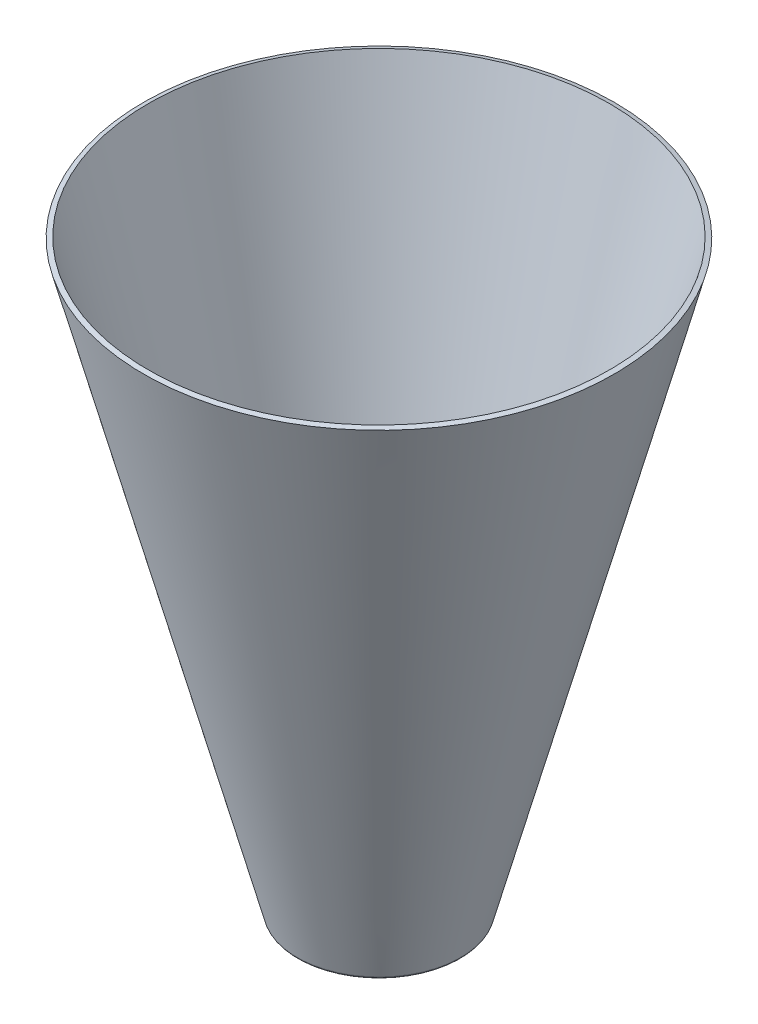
from build123d import *


with BuildPart() as part:
    # Esquisse1 → R_vol.-Mince1 (revolve)
    with BuildSketch(Plane.XY, mode=Mode.PRIVATE) as r_vol_mince1_sk:
        with BuildLine():
            Line((5, 0), (24.229656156, 0))
            ThreePointArc((24.229656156, 0), (24.839920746, 0.207802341), (25.196556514, 0.744845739))
            Line((25.196556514, 0.744845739), (72.5, 180))
            Line((72.5, 180), (71.049649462, 180.382731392))
            Line((71.049649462, 180.382731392), (23.844484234, 1.5))
            Line((23.844484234, 1.5), (5, 1.5))
            Line((5, 1.5), (5, 0))
        make_face()
    revolve(r_vol_mince1_sk.sketch.rotate(Axis((0, 0, 0), (0, 1, 0)), 90), axis=Axis((0, 0, 0), (0, 1, 0)))


solid = part.part
